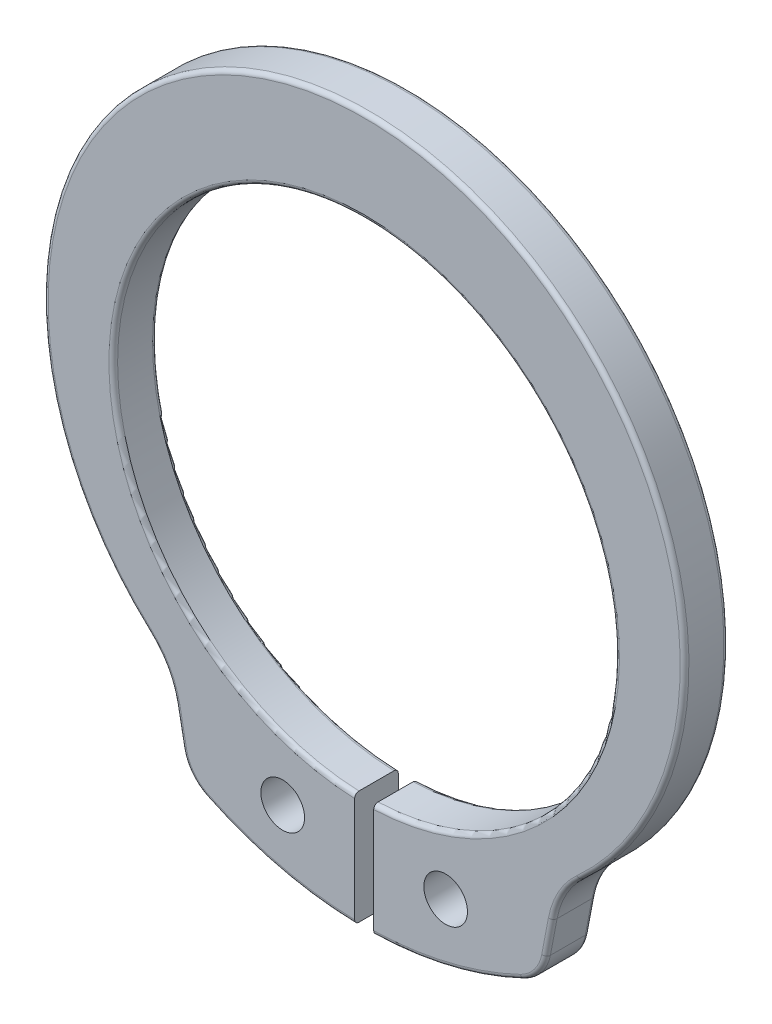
from build123d import *

# Parameters (mm, degrees)
SKETCH3_R           = 0.635
BOSS_EXTRUDE1_DEPTH = 0.635
FILLET1_R           = 2.54
FILLET2_R           = 1.27
FILLET3_R           = 0.127


with BuildPart() as part:
    # Sketch3 → Boss-Extrude1 (new, symmetric)
    with BuildSketch(Plane.XY):
        with BuildLine():
            Line((-5.176388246, -9.259456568), (-5.656121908, -6.74297013))
            ThreePointArc((-5.656121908, -6.74297013), (-8.833855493, 3.655464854), (0, 9.9949))
            Line((0, 9.9949), (0, 7.3025))
            ThreePointArc((0, 7.3025), (-7.301179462, 0.138869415), (-0.277688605, -7.297218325))
            Line((-0.277688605, -7.297218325), (-0.277688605, -10.6045))
            ThreePointArc((-0.277688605, -10.6045), (-2.808740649, -10.229540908), (-5.176388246, -9.259456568))
        make_face()
        with Locations((-2.371120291, -8.63571082)):
            Circle(SKETCH3_R, mode=Mode.SUBTRACT)
    extrude(amount=BOSS_EXTRUDE1_DEPTH, both=True)

    # Fillet1
    fillet1_edges = [part.edges().sort_by_distance(p)[0] for p in [
        (-5.656121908, -6.74297013, 0),
    ]]
    fillet(fillet1_edges, radius=FILLET1_R)

    # Fillet2
    fillet2_edges = [part.edges().sort_by_distance(p)[0] for p in [
        (-5.176388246, -9.259456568, 0),
    ]]
    fillet(fillet2_edges, radius=FILLET2_R)

    # Mirror1: part across plane


with BuildPart() as part_1:
    add(part.part)
    add(part.part.mirror(Plane(origin=(0, 9.9949, 0.635), x_dir=(0, 0, 1), z_dir=(-1, 0, 0))))

    # Fillet3
    fillet3_edges = [part_1.edges().sort_by_distance(p)[0] for p in [
        (-7.301179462, 0.138869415, 0.635),
        (-5.389088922, -8.143715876, -0.635),
        (-5.389088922, -8.143715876, 0.635),
        (-5.765619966, -6.866859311, -0.635),
        (-5.765619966, -6.866859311, 0.635),
        (-2.49108234, -10.311500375, -0.635),
        (-2.49108234, -10.311500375, 0.635),
        (-5.05079943, -9.191269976, -0.635),
        (-5.05079943, -9.191269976, 0.635),
        (-8.697147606, 4.033012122, 0.635),
        (2.49108234, -10.311500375, -0.635),
        (5.389088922, -8.143715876, -0.635),
        (5.389088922, -8.143715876, 0.635),
        (2.49108234, -10.311500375, 0.635),
        (5.765619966, -6.866859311, 0.635),
        (5.765619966, -6.866859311, -0.635),
        (5.05079943, -9.191269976, 0.635),
        (5.05079943, -9.191269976, -0.635),
        (-7.301179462, 0.138869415, -0.635),
        (-8.697147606, 4.033012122, -0.635),
    ]]
    fillet(fillet3_edges, radius=FILLET3_R)


solid = part_1.part
